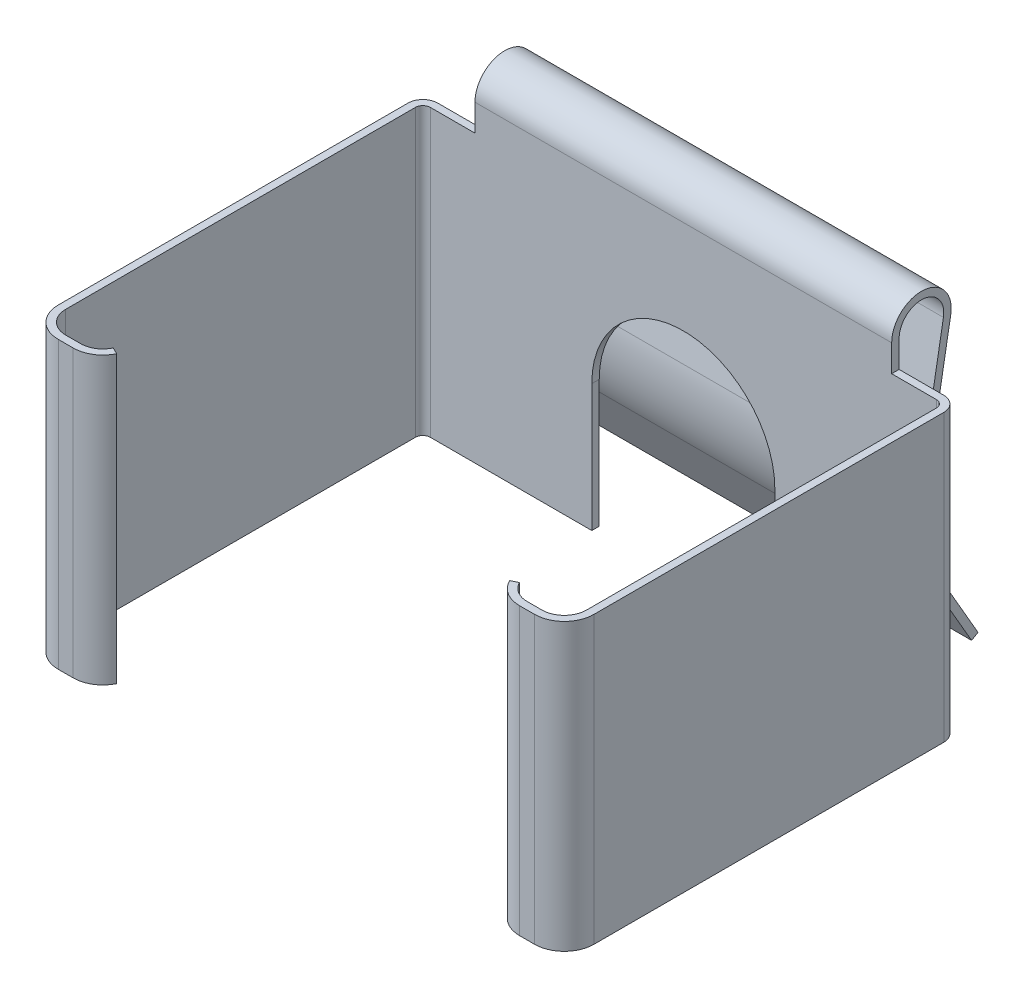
ISO-10303-21;
HEADER;
FILE_DESCRIPTION(('STEP AP214'),'2;1');
FILE_NAME('part.step','',(''),(''),'','','');
FILE_SCHEMA(('AUTOMOTIVE_DESIGN { 1 0 10303 214 1 1 1 1 }'));
ENDSEC;
DATA;
#1=APPLICATION_CONTEXT('core data for automotive mechanical design processes');
#2=APPLICATION_PROTOCOL_DEFINITION('international standard','automotive_design',2000,#1);
#3=PRODUCT_CONTEXT('',#1,'mechanical');
#4=PRODUCT('Part','Part','',(#3));
#5=PRODUCT_RELATED_PRODUCT_CATEGORY('part','',(#4));
#6=PRODUCT_DEFINITION_FORMATION('','',#4);
#7=PRODUCT_DEFINITION_CONTEXT('part definition',#1,'design');
#8=PRODUCT_DEFINITION('design','',#6,#7);
#9=PRODUCT_DEFINITION_SHAPE('','',#8);
#10=(LENGTH_UNIT() NAMED_UNIT(*) SI_UNIT(.MILLI.,.METRE.));
#11=(NAMED_UNIT(*) PLANE_ANGLE_UNIT() SI_UNIT($,.RADIAN.));
#12=(NAMED_UNIT(*) SI_UNIT($,.STERADIAN.) SOLID_ANGLE_UNIT());
#13=UNCERTAINTY_MEASURE_WITH_UNIT(LENGTH_MEASURE(1.E-05),#10,'distance_accuracy_value','');
#14=(GEOMETRIC_REPRESENTATION_CONTEXT(3) GLOBAL_UNCERTAINTY_ASSIGNED_CONTEXT((#13)) GLOBAL_UNIT_ASSIGNED_CONTEXT((#10,
#11,#12)) REPRESENTATION_CONTEXT('',''));
#15=CARTESIAN_POINT('',(0.,0.,0.));
#16=DIRECTION('',(0.,0.,1.));
#17=DIRECTION('',(1.,0.,0.));
#18=AXIS2_PLACEMENT_3D('',#15,#16,#17);
#19=CARTESIAN_POINT('',(-37.0000000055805,34.2,27.4999999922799));
#20=DIRECTION('',(0.,-1.,0.));
#21=DIRECTION('',(0.,0.,-1.));
#22=AXIS2_PLACEMENT_3D('',#19,#20,#21);
#23=CYLINDRICAL_SURFACE('',#22,1.50000000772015);
#24=DIRECTION('',(0.,1.,0.));
#25=VECTOR('',#24,1.);
#26=CARTESIAN_POINT('',(-37.,34.2,29.));
#27=LINE('',#26,#25);
#28=CARTESIAN_POINT('',(-37.0000000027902,34.2,29.));
#29=VERTEX_POINT('',#28);
#30=CARTESIAN_POINT('',(-37.0000000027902,15.,29.));
#31=VERTEX_POINT('',#30);
#32=EDGE_CURVE('E279',#29,#31,#27,.F.);
#33=ORIENTED_EDGE('',*,*,#32,.F.);
#34=CARTESIAN_POINT('',(-37.0000000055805,34.2,27.4999999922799));
#35=DIRECTION('',(0.,-1.,0.));
#36=DIRECTION('',(0.,0.,-1.));
#37=AXIS2_PLACEMENT_3D('',#34,#35,#36);
#38=CIRCLE('',#37,1.50000000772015);
#39=CARTESIAN_POINT('',(-35.65,34.2,28.15383484));
#40=VERTEX_POINT('',#39);
#41=EDGE_CURVE('E20',#40,#29,#38,.T.);
#42=ORIENTED_EDGE('',*,*,#41,.F.);
#43=DIRECTION('',(0.,1.,0.));
#44=VECTOR('',#43,1.);
#45=CARTESIAN_POINT('',(-35.65,34.2,28.15383484));
#46=LINE('',#45,#44);
#47=CARTESIAN_POINT('',(-35.65,15.,28.15383484));
#48=VERTEX_POINT('',#47);
#49=EDGE_CURVE('E276',#48,#40,#46,.T.);
#50=ORIENTED_EDGE('',*,*,#49,.F.);
#51=CARTESIAN_POINT('',(-37.0000000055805,15.,27.4999999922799));
#52=DIRECTION('',(0.,-1.,0.));
#53=DIRECTION('',(0.,0.,-1.));
#54=AXIS2_PLACEMENT_3D('',#51,#52,#53);
#55=CIRCLE('',#54,1.50000000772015);
#56=EDGE_CURVE('E282',#31,#48,#55,.F.);
#57=ORIENTED_EDGE('',*,*,#56,.F.);
#58=EDGE_LOOP('',(#33,#42,#50,#57));
#59=FACE_BOUND('',#58,.T.);
#60=ADVANCED_FACE('F17',(#59),#23,.F.);
#61=CARTESIAN_POINT('',(-6.99999999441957,34.2,27.4999999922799));
#62=DIRECTION('',(0.,-1.,0.));
#63=DIRECTION('',(0.,0.,-1.));
#64=AXIS2_PLACEMENT_3D('',#61,#62,#63);
#65=CYLINDRICAL_SURFACE('',#64,1.50000000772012);
#66=DIRECTION('',(0.,1.,0.));
#67=VECTOR('',#66,1.);
#68=CARTESIAN_POINT('',(-8.35,34.2,28.15383484));
#69=LINE('',#68,#67);
#70=CARTESIAN_POINT('',(-8.35,34.2,28.15383484));
#71=VERTEX_POINT('',#70);
#72=CARTESIAN_POINT('',(-8.35,15.,28.15383484));
#73=VERTEX_POINT('',#72);
#74=EDGE_CURVE('E300',#71,#73,#69,.F.);
#75=ORIENTED_EDGE('',*,*,#74,.F.);
#76=CARTESIAN_POINT('',(-6.99999999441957,34.2,27.4999999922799));
#77=DIRECTION('',(0.,-1.,0.));
#78=DIRECTION('',(0.,0.,-1.));
#79=AXIS2_PLACEMENT_3D('',#76,#77,#78);
#80=CIRCLE('',#79,1.50000000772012);
#81=CARTESIAN_POINT('',(-6.99999999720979,34.2,29.));
#82=VERTEX_POINT('',#81);
#83=EDGE_CURVE('E410',#82,#71,#80,.T.);
#84=ORIENTED_EDGE('',*,*,#83,.F.);
#85=DIRECTION('',(0.,1.,0.));
#86=VECTOR('',#85,1.);
#87=CARTESIAN_POINT('',(-7.,34.2,29.));
#88=LINE('',#87,#86);
#89=CARTESIAN_POINT('',(-6.99999999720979,15.,29.));
#90=VERTEX_POINT('',#89);
#91=EDGE_CURVE('E421',#90,#82,#88,.T.);
#92=ORIENTED_EDGE('',*,*,#91,.F.);
#93=CARTESIAN_POINT('',(-6.99999999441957,15.,27.4999999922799));
#94=DIRECTION('',(0.,-1.,0.));
#95=DIRECTION('',(0.,0.,-1.));
#96=AXIS2_PLACEMENT_3D('',#93,#94,#95);
#97=CIRCLE('',#96,1.50000000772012);
#98=EDGE_CURVE('E407',#73,#90,#97,.F.);
#99=ORIENTED_EDGE('',*,*,#98,.F.);
#100=EDGE_LOOP('',(#75,#84,#92,#99));
#101=FACE_BOUND('',#100,.T.);
#102=ADVANCED_FACE('F725',(#101),#65,.F.);
#103=CARTESIAN_POINT('',(-37.,34.2,29.));
#104=DIRECTION('',(0.,0.,-1.));
#105=DIRECTION('',(-1.,0.,0.));
#106=AXIS2_PLACEMENT_3D('',#103,#104,#105);
#107=PLANE('',#106);
#108=DIRECTION('',(-1.,0.,0.));
#109=VECTOR('',#108,1.);
#110=CARTESIAN_POINT('',(-37.,34.2,29.));
#111=LINE('',#110,#109);
#112=CARTESIAN_POINT('',(-37.9999999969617,34.2,29.));
#113=VERTEX_POINT('',#112);
#114=EDGE_CURVE('E303',#113,#29,#111,.F.);
#115=ORIENTED_EDGE('',*,*,#114,.T.);
#116=ORIENTED_EDGE('',*,*,#32,.T.);
#117=DIRECTION('',(-1.,0.,0.));
#118=VECTOR('',#117,1.);
#119=CARTESIAN_POINT('',(-37.,15.,29.));
#120=LINE('',#119,#118);
#121=CARTESIAN_POINT('',(-37.9999999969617,15.,29.));
#122=VERTEX_POINT('',#121);
#123=EDGE_CURVE('E409',#31,#122,#120,.T.);
#124=ORIENTED_EDGE('',*,*,#123,.T.);
#125=DIRECTION('',(0.,-1.,0.));
#126=VECTOR('',#125,1.);
#127=CARTESIAN_POINT('',(-38.,34.2,29.));
#128=LINE('',#127,#126);
#129=EDGE_CURVE('E417',#122,#113,#128,.F.);
#130=ORIENTED_EDGE('',*,*,#129,.T.);
#131=EDGE_LOOP('',(#115,#116,#124,#130));
#132=FACE_BOUND('',#131,.T.);
#133=ADVANCED_FACE('F414',(#132),#107,.T.);
#134=CARTESIAN_POINT('',(-35.2,34.2,28.37177979));
#135=DIRECTION('',(0.435889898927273,0.,-0.899999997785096));
#136=DIRECTION('',(-0.899999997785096,0.,-0.435889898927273));
#137=AXIS2_PLACEMENT_3D('',#134,#135,#136);
#138=PLANE('',#137);
#139=DIRECTION('',(-0.899999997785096,0.,-0.435889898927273));
#140=VECTOR('',#139,1.);
#141=CARTESIAN_POINT('',(-35.2,34.2,28.37177979));
#142=LINE('',#141,#140);
#143=CARTESIAN_POINT('',(-35.2,34.2,28.37177979));
#144=VERTEX_POINT('',#143);
#145=EDGE_CURVE('E284',#40,#144,#142,.F.);
#146=ORIENTED_EDGE('',*,*,#145,.T.);
#147=DIRECTION('',(0.,-1.,0.));
#148=VECTOR('',#147,1.);
#149=CARTESIAN_POINT('',(-35.2,34.2,28.37177979));
#150=LINE('',#149,#148);
#151=CARTESIAN_POINT('',(-35.2,15.,28.37177979));
#152=VERTEX_POINT('',#151);
#153=EDGE_CURVE('E570',#152,#144,#150,.F.);
#154=ORIENTED_EDGE('',*,*,#153,.F.);
#155=DIRECTION('',(-0.899999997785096,0.,-0.435889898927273));
#156=VECTOR('',#155,1.);
#157=CARTESIAN_POINT('',(-35.2,15.,28.37177979));
#158=LINE('',#157,#156);
#159=EDGE_CURVE('E295',#152,#48,#158,.T.);
#160=ORIENTED_EDGE('',*,*,#159,.T.);
#161=ORIENTED_EDGE('',*,*,#49,.T.);
#162=EDGE_LOOP('',(#146,#154,#160,#161));
#163=FACE_BOUND('',#162,.T.);
#164=ADVANCED_FACE('F294',(#163),#138,.T.);
#165=CARTESIAN_POINT('',(-38.,34.2,29.5));
#166=DIRECTION('',(0.,0.,1.));
#167=DIRECTION('',(1.,0.,0.));
#168=AXIS2_PLACEMENT_3D('',#165,#166,#167);
#169=PLANE('',#168);
#170=DIRECTION('',(1.,0.,0.));
#171=VECTOR('',#170,1.);
#172=CARTESIAN_POINT('',(-38.,34.2,29.5));
#173=LINE('',#172,#171);
#174=CARTESIAN_POINT('',(-37.0000000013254,34.2,29.5));
#175=VERTEX_POINT('',#174);
#176=CARTESIAN_POINT('',(-37.9999999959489,34.2,29.5));
#177=VERTEX_POINT('',#176);
#178=EDGE_CURVE('E445',#175,#177,#173,.F.);
#179=ORIENTED_EDGE('',*,*,#178,.T.);
#180=DIRECTION('',(0.,-1.,0.));
#181=VECTOR('',#180,1.);
#182=CARTESIAN_POINT('',(-38.,34.2,29.5));
#183=LINE('',#182,#181);
#184=CARTESIAN_POINT('',(-37.9999999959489,15.,29.5));
#185=VERTEX_POINT('',#184);
#186=EDGE_CURVE('E457',#185,#177,#183,.F.);
#187=ORIENTED_EDGE('',*,*,#186,.F.);
#188=DIRECTION('',(1.,0.,0.));
#189=VECTOR('',#188,1.);
#190=CARTESIAN_POINT('',(-38.,15.,29.5));
#191=LINE('',#190,#189);
#192=CARTESIAN_POINT('',(-37.0000000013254,15.,29.5));
#193=VERTEX_POINT('',#192);
#194=EDGE_CURVE('E292',#185,#193,#191,.T.);
#195=ORIENTED_EDGE('',*,*,#194,.T.);
#196=DIRECTION('',(0.,-1.,0.));
#197=VECTOR('',#196,1.);
#198=CARTESIAN_POINT('',(-37.,34.2,29.5));
#199=LINE('',#198,#197);
#200=EDGE_CURVE('E460',#175,#193,#199,.T.);
#201=ORIENTED_EDGE('',*,*,#200,.F.);
#202=EDGE_LOOP('',(#179,#187,#195,#201));
#203=FACE_BOUND('',#202,.T.);
#204=ADVANCED_FACE('F456',(#203),#169,.T.);
#205=CARTESIAN_POINT('',(-36.,16.24999999,-2.30000001));
#206=DIRECTION('',(0.,-0.866025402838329,-0.50000000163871));
#207=DIRECTION('',(0.,0.50000000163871,-0.866025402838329));
#208=AXIS2_PLACEMENT_3D('',#205,#206,#207);
#209=PLANE('',#208);
#210=DIRECTION('',(0.,0.50000000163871,-0.866025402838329));
#211=VECTOR('',#210,1.);
#212=CARTESIAN_POINT('',(-36.,16.24999999,-2.30000001));
#213=LINE('',#212,#211);
#214=CARTESIAN_POINT('',(-36.,15.99999999,-1.86698731));
#215=VERTEX_POINT('',#214);
#216=CARTESIAN_POINT('',(-36.,16.24999999,-2.30000001));
#217=VERTEX_POINT('',#216);
#218=EDGE_CURVE('E441',#215,#217,#213,.T.);
#219=ORIENTED_EDGE('',*,*,#218,.T.);
#220=DIRECTION('',(1.,0.,0.));
#221=VECTOR('',#220,1.);
#222=CARTESIAN_POINT('',(-36.,16.24999999,-2.30000001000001));
#223=LINE('',#222,#221);
#224=CARTESIAN_POINT('',(-7.99999999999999,16.24999999,-2.30000001));
#225=VERTEX_POINT('',#224);
#226=EDGE_CURVE('E548',#225,#217,#223,.F.);
#227=ORIENTED_EDGE('',*,*,#226,.F.);
#228=DIRECTION('',(0.,0.50000000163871,-0.866025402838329));
#229=VECTOR('',#228,1.);
#230=CARTESIAN_POINT('',(-7.99999999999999,16.24999999,-2.30000001));
#231=LINE('',#230,#229);
#232=CARTESIAN_POINT('',(-7.99999999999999,15.99999999,-1.86698731));
#233=VERTEX_POINT('',#232);
#234=EDGE_CURVE('E443',#225,#233,#231,.F.);
#235=ORIENTED_EDGE('',*,*,#234,.T.);
#236=DIRECTION('',(1.,0.,0.));
#237=VECTOR('',#236,1.);
#238=CARTESIAN_POINT('',(-36.,15.99999999,-1.86698731));
#239=LINE('',#238,#237);
#240=EDGE_CURVE('E551',#215,#233,#239,.T.);
#241=ORIENTED_EDGE('',*,*,#240,.F.);
#242=EDGE_LOOP('',(#219,#227,#235,#241));
#243=FACE_BOUND('',#242,.T.);
#244=ADVANCED_FACE('F1092',(#243),#209,.T.);
#245=CARTESIAN_POINT('',(-7.,34.2,29.5));
#246=DIRECTION('',(0.,0.,1.));
#247=DIRECTION('',(1.,0.,0.));
#248=AXIS2_PLACEMENT_3D('',#245,#246,#247);
#249=PLANE('',#248);
#250=DIRECTION('',(1.,0.,0.));
#251=VECTOR('',#250,1.);
#252=CARTESIAN_POINT('',(-7.,34.2,29.5));
#253=LINE('',#252,#251);
#254=CARTESIAN_POINT('',(-6.00000000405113,34.2,29.5));
#255=VERTEX_POINT('',#254);
#256=CARTESIAN_POINT('',(-6.99999999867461,34.2,29.5));
#257=VERTEX_POINT('',#256);
#258=EDGE_CURVE('E438',#255,#257,#253,.F.);
#259=ORIENTED_EDGE('',*,*,#258,.T.);
#260=DIRECTION('',(0.,-1.,0.));
#261=VECTOR('',#260,1.);
#262=CARTESIAN_POINT('',(-7.,34.2,29.5));
#263=LINE('',#262,#261);
#264=CARTESIAN_POINT('',(-6.99999999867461,15.,29.5));
#265=VERTEX_POINT('',#264);
#266=EDGE_CURVE('E530',#265,#257,#263,.F.);
#267=ORIENTED_EDGE('',*,*,#266,.F.);
#268=DIRECTION('',(1.,0.,0.));
#269=VECTOR('',#268,1.);
#270=CARTESIAN_POINT('',(-7.,15.,29.5));
#271=LINE('',#270,#269);
#272=CARTESIAN_POINT('',(-6.00000000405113,15.,29.5));
#273=VERTEX_POINT('',#272);
#274=EDGE_CURVE('E439',#265,#273,#271,.T.);
#275=ORIENTED_EDGE('',*,*,#274,.T.);
#276=DIRECTION('',(0.,-1.,0.));
#277=VECTOR('',#276,1.);
#278=CARTESIAN_POINT('',(-6.,34.2,29.5));
#279=LINE('',#278,#277);
#280=EDGE_CURVE('E533',#255,#273,#279,.T.);
#281=ORIENTED_EDGE('',*,*,#280,.F.);
#282=EDGE_LOOP('',(#259,#267,#275,#281));
#283=FACE_BOUND('',#282,.T.);
#284=ADVANCED_FACE('F713',(#283),#249,.T.);
#285=CARTESIAN_POINT('',(-8.35,34.2,28.15383484));
#286=DIRECTION('',(-0.435889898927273,0.,-0.899999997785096));
#287=DIRECTION('',(-0.899999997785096,0.,0.435889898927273));
#288=AXIS2_PLACEMENT_3D('',#285,#286,#287);
#289=PLANE('',#288);
#290=DIRECTION('',(-0.899999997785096,0.,0.435889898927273));
#291=VECTOR('',#290,1.);
#292=CARTESIAN_POINT('',(-8.35,34.2,28.15383484));
#293=LINE('',#292,#291);
#294=CARTESIAN_POINT('',(-8.8,34.2,28.37177979));
#295=VERTEX_POINT('',#294);
#296=EDGE_CURVE('E431',#295,#71,#293,.F.);
#297=ORIENTED_EDGE('',*,*,#296,.T.);
#298=ORIENTED_EDGE('',*,*,#74,.T.);
#299=DIRECTION('',(-0.899999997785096,0.,0.435889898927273));
#300=VECTOR('',#299,1.);
#301=CARTESIAN_POINT('',(-8.35,15.,28.15383484));
#302=LINE('',#301,#300);
#303=CARTESIAN_POINT('',(-8.8,15.,28.37177979));
#304=VERTEX_POINT('',#303);
#305=EDGE_CURVE('E436',#73,#304,#302,.T.);
#306=ORIENTED_EDGE('',*,*,#305,.T.);
#307=DIRECTION('',(0.,-1.,0.));
#308=VECTOR('',#307,1.);
#309=CARTESIAN_POINT('',(-8.8,34.2,28.37177979));
#310=LINE('',#309,#308);
#311=EDGE_CURVE('E527',#295,#304,#310,.T.);
#312=ORIENTED_EDGE('',*,*,#311,.F.);
#313=EDGE_LOOP('',(#297,#298,#306,#312));
#314=FACE_BOUND('',#313,.T.);
#315=ADVANCED_FACE('F722',(#314),#289,.T.);
#316=CARTESIAN_POINT('',(-6.,34.2,29.));
#317=DIRECTION('',(0.,0.,-1.));
#318=DIRECTION('',(-1.,0.,0.));
#319=AXIS2_PLACEMENT_3D('',#316,#317,#318);
#320=PLANE('',#319);
#321=DIRECTION('',(-1.,0.,0.));
#322=VECTOR('',#321,1.);
#323=CARTESIAN_POINT('',(-6.,34.2,29.));
#324=LINE('',#323,#322);
#325=CARTESIAN_POINT('',(-6.00000000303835,34.2,29.));
#326=VERTEX_POINT('',#325);
#327=EDGE_CURVE('E406',#82,#326,#324,.F.);
#328=ORIENTED_EDGE('',*,*,#327,.T.);
#329=DIRECTION('',(0.,-1.,0.));
#330=VECTOR('',#329,1.);
#331=CARTESIAN_POINT('',(-6.,34.2,29.));
#332=LINE('',#331,#330);
#333=CARTESIAN_POINT('',(-6.00000000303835,15.,29.));
#334=VERTEX_POINT('',#333);
#335=EDGE_CURVE('E523',#326,#334,#332,.T.);
#336=ORIENTED_EDGE('',*,*,#335,.T.);
#337=DIRECTION('',(-1.,0.,0.));
#338=VECTOR('',#337,1.);
#339=CARTESIAN_POINT('',(-6.,15.,29.));
#340=LINE('',#339,#338);
#341=EDGE_CURVE('E423',#334,#90,#340,.T.);
#342=ORIENTED_EDGE('',*,*,#341,.T.);
#343=ORIENTED_EDGE('',*,*,#91,.T.);
#344=EDGE_LOOP('',(#328,#336,#342,#343));
#345=FACE_BOUND('',#344,.T.);
#346=ADVANCED_FACE('F729',(#345),#320,.T.);
#347=CARTESIAN_POINT('',(-5.00000000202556,34.2,4.00000000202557));
#348=DIRECTION('',(0.,-1.,0.));
#349=DIRECTION('',(0.,0.,-1.));
#350=AXIS2_PLACEMENT_3D('',#347,#348,#349);
#351=CYLINDRICAL_SURFACE('',#350,0.500000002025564);
#352=DIRECTION('',(0.,1.,0.));
#353=VECTOR('',#352,1.);
#354=CARTESIAN_POINT('',(-4.5,34.2,4.));
#355=LINE('',#354,#353);
#356=CARTESIAN_POINT('',(-4.5,34.2,4.00000000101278));
#357=VERTEX_POINT('',#356);
#358=CARTESIAN_POINT('',(-4.5,15.,4.00000000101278));
#359=VERTEX_POINT('',#358);
#360=EDGE_CURVE('E519',#357,#359,#355,.F.);
#361=ORIENTED_EDGE('',*,*,#360,.F.);
#362=CARTESIAN_POINT('',(-5.00000000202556,34.2,4.00000000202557));
#363=DIRECTION('',(0.,-1.,0.));
#364=DIRECTION('',(0.,0.,-1.));
#365=AXIS2_PLACEMENT_3D('',#362,#363,#364);
#366=CIRCLE('',#365,0.500000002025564);
#367=CARTESIAN_POINT('',(-5.00000000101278,34.2,3.5));
#368=VERTEX_POINT('',#367);
#369=EDGE_CURVE('E404',#368,#357,#366,.T.);
#370=ORIENTED_EDGE('',*,*,#369,.F.);
#371=DIRECTION('',(0.,1.,0.));
#372=VECTOR('',#371,1.);
#373=CARTESIAN_POINT('',(-5.,34.2,3.5));
#374=LINE('',#373,#372);
#375=CARTESIAN_POINT('',(-5.00000000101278,15.,3.5));
#376=VERTEX_POINT('',#375);
#377=EDGE_CURVE('E515',#376,#368,#374,.T.);
#378=ORIENTED_EDGE('',*,*,#377,.F.);
#379=CARTESIAN_POINT('',(-5.00000000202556,15.,4.00000000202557));
#380=DIRECTION('',(0.,-1.,0.));
#381=DIRECTION('',(0.,0.,-1.));
#382=AXIS2_PLACEMENT_3D('',#379,#380,#381);
#383=CIRCLE('',#382,0.500000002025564);
#384=EDGE_CURVE('E402',#359,#376,#383,.F.);
#385=ORIENTED_EDGE('',*,*,#384,.F.);
#386=EDGE_LOOP('',(#361,#370,#378,#385));
#387=FACE_BOUND('',#386,.T.);
#388=ADVANCED_FACE('F741',(#387),#351,.F.);
#389=CARTESIAN_POINT('',(-38.9999999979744,34.2,4.00000000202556));
#390=DIRECTION('',(0.,-1.,0.));
#391=DIRECTION('',(0.,0.,-1.));
#392=AXIS2_PLACEMENT_3D('',#389,#390,#391);
#393=CYLINDRICAL_SURFACE('',#392,0.500000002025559);
#394=DIRECTION('',(0.,1.,0.));
#395=VECTOR('',#394,1.);
#396=CARTESIAN_POINT('',(-39.,34.2,3.5));
#397=LINE('',#396,#395);
#398=CARTESIAN_POINT('',(-38.9999999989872,34.2,3.5));
#399=VERTEX_POINT('',#398);
#400=CARTESIAN_POINT('',(-38.9999999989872,15.,3.5));
#401=VERTEX_POINT('',#400);
#402=EDGE_CURVE('E396',#399,#401,#397,.F.);
#403=ORIENTED_EDGE('',*,*,#402,.F.);
#404=CARTESIAN_POINT('',(-38.9999999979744,34.2,4.00000000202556));
#405=DIRECTION('',(0.,-1.,0.));
#406=DIRECTION('',(0.,0.,-1.));
#407=AXIS2_PLACEMENT_3D('',#404,#405,#406);
#408=CIRCLE('',#407,0.500000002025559);
#409=CARTESIAN_POINT('',(-39.5,34.2,4.00000000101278));
#410=VERTEX_POINT('',#409);
#411=EDGE_CURVE('E400',#410,#399,#408,.T.);
#412=ORIENTED_EDGE('',*,*,#411,.F.);
#413=DIRECTION('',(0.,1.,0.));
#414=VECTOR('',#413,1.);
#415=CARTESIAN_POINT('',(-39.5,34.2,4.));
#416=LINE('',#415,#414);
#417=CARTESIAN_POINT('',(-39.5,15.,4.00000000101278));
#418=VERTEX_POINT('',#417);
#419=EDGE_CURVE('E399',#418,#410,#416,.T.);
#420=ORIENTED_EDGE('',*,*,#419,.F.);
#421=CARTESIAN_POINT('',(-38.9999999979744,15.,4.00000000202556));
#422=DIRECTION('',(0.,-1.,0.));
#423=DIRECTION('',(0.,0.,-1.));
#424=AXIS2_PLACEMENT_3D('',#421,#422,#423);
#425=CIRCLE('',#424,0.500000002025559);
#426=EDGE_CURVE('E397',#401,#418,#425,.F.);
#427=ORIENTED_EDGE('',*,*,#426,.F.);
#428=EDGE_LOOP('',(#403,#412,#420,#427));
#429=FACE_BOUND('',#428,.T.);
#430=ADVANCED_FACE('F1049',(#429),#393,.F.);
#431=CARTESIAN_POINT('',(-39.5,34.2,27.5));
#432=DIRECTION('',(1.,0.,0.));
#433=DIRECTION('',(0.,0.,-1.));
#434=AXIS2_PLACEMENT_3D('',#431,#432,#433);
#435=PLANE('',#434);
#436=DIRECTION('',(0.,0.,-1.));
#437=VECTOR('',#436,1.);
#438=CARTESIAN_POINT('',(-39.5,34.2,12.6187808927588));
#439=LINE('',#438,#437);
#440=CARTESIAN_POINT('',(-39.5,34.2,27.4999999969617));
#441=VERTEX_POINT('',#440);
#442=EDGE_CURVE('E377',#410,#441,#439,.F.);
#443=ORIENTED_EDGE('',*,*,#442,.T.);
#444=DIRECTION('',(0.,-1.,0.));
#445=VECTOR('',#444,1.);
#446=CARTESIAN_POINT('',(-39.5,34.2,27.5));
#447=LINE('',#446,#445);
#448=CARTESIAN_POINT('',(-39.5,15.,27.4999999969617));
#449=VERTEX_POINT('',#448);
#450=EDGE_CURVE('E572',#441,#449,#447,.T.);
#451=ORIENTED_EDGE('',*,*,#450,.T.);
#452=DIRECTION('',(0.,0.,-1.));
#453=VECTOR('',#452,1.);
#454=CARTESIAN_POINT('',(-39.5,15.,12.6187808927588));
#455=LINE('',#454,#453);
#456=EDGE_CURVE('E392',#418,#449,#455,.F.);
#457=ORIENTED_EDGE('',*,*,#456,.F.);
#458=ORIENTED_EDGE('',*,*,#419,.T.);
#459=EDGE_LOOP('',(#443,#451,#457,#458));
#460=FACE_BOUND('',#459,.T.);
#461=ADVANCED_FACE('F1039',(#460),#435,.T.);
#462=CARTESIAN_POINT('',(-37.9999999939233,34.2,27.4999999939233));
#463=DIRECTION('',(0.,-1.,0.));
#464=DIRECTION('',(0.,0.,-1.));
#465=AXIS2_PLACEMENT_3D('',#462,#463,#464);
#466=CYLINDRICAL_SURFACE('',#465,1.5000000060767);
#467=ORIENTED_EDGE('',*,*,#450,.F.);
#468=CARTESIAN_POINT('',(-37.9999999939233,34.2,27.4999999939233));
#469=DIRECTION('',(0.,-1.,0.));
#470=DIRECTION('',(0.,0.,-1.));
#471=AXIS2_PLACEMENT_3D('',#468,#469,#470);
#472=CIRCLE('',#471,1.5000000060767);
#473=EDGE_CURVE('E374',#441,#113,#472,.F.);
#474=ORIENTED_EDGE('',*,*,#473,.T.);
#475=ORIENTED_EDGE('',*,*,#129,.F.);
#476=CARTESIAN_POINT('',(-37.9999999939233,15.,27.4999999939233));
#477=DIRECTION('',(0.,-1.,0.));
#478=DIRECTION('',(0.,0.,-1.));
#479=AXIS2_PLACEMENT_3D('',#476,#477,#478);
#480=CIRCLE('',#479,1.5000000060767);
#481=EDGE_CURVE('E389',#449,#122,#480,.F.);
#482=ORIENTED_EDGE('',*,*,#481,.F.);
#483=EDGE_LOOP('',(#467,#474,#475,#482));
#484=FACE_BOUND('',#483,.T.);
#485=ADVANCED_FACE('F1029',(#484),#466,.F.);
#486=CARTESIAN_POINT('',(-37.0000000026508,34.2,27.4999999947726));
#487=DIRECTION('',(0.,-1.,0.));
#488=DIRECTION('',(0.,0.,-1.));
#489=AXIS2_PLACEMENT_3D('',#486,#487,#488);
#490=CYLINDRICAL_SURFACE('',#489,2.00000000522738);
#491=CARTESIAN_POINT('',(-37.0000000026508,34.2,27.4999999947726));
#492=DIRECTION('',(0.,-1.,0.));
#493=DIRECTION('',(0.,0.,-1.));
#494=AXIS2_PLACEMENT_3D('',#491,#492,#493);
#495=CIRCLE('',#494,2.00000000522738);
#496=EDGE_CURVE('E288',#144,#175,#495,.T.);
#497=ORIENTED_EDGE('',*,*,#496,.T.);
#498=ORIENTED_EDGE('',*,*,#200,.T.);
#499=CARTESIAN_POINT('',(-37.0000000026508,15.,27.4999999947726));
#500=DIRECTION('',(0.,-1.,0.));
#501=DIRECTION('',(0.,0.,-1.));
#502=AXIS2_PLACEMENT_3D('',#499,#500,#501);
#503=CIRCLE('',#502,2.00000000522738);
#504=EDGE_CURVE('E386',#152,#193,#503,.T.);
#505=ORIENTED_EDGE('',*,*,#504,.F.);
#506=ORIENTED_EDGE('',*,*,#153,.T.);
#507=EDGE_LOOP('',(#497,#498,#505,#506));
#508=FACE_BOUND('',#507,.T.);
#509=ADVANCED_FACE('F1020',(#508),#490,.T.);
#510=CARTESIAN_POINT('',(-37.9999999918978,34.2,27.4999999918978));
#511=DIRECTION('',(0.,-1.,0.));
#512=DIRECTION('',(0.,0.,-1.));
#513=AXIS2_PLACEMENT_3D('',#510,#511,#512);
#514=CYLINDRICAL_SURFACE('',#513,2.00000000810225);
#515=CARTESIAN_POINT('',(-37.9999999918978,34.2,27.4999999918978));
#516=DIRECTION('',(0.,-1.,0.));
#517=DIRECTION('',(0.,0.,-1.));
#518=AXIS2_PLACEMENT_3D('',#515,#516,#517);
#519=CIRCLE('',#518,2.00000000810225);
#520=CARTESIAN_POINT('',(-40.,34.2,27.4999999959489));
#521=VERTEX_POINT('',#520);
#522=EDGE_CURVE('E371',#177,#521,#519,.T.);
#523=ORIENTED_EDGE('',*,*,#522,.T.);
#524=DIRECTION('',(0.,1.,0.));
#525=VECTOR('',#524,1.);
#526=CARTESIAN_POINT('',(-40.,34.2,27.5));
#527=LINE('',#526,#525);
#528=CARTESIAN_POINT('',(-40.,15.,27.4999999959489));
#529=VERTEX_POINT('',#528);
#530=EDGE_CURVE('E465',#529,#521,#527,.T.);
#531=ORIENTED_EDGE('',*,*,#530,.F.);
#532=CARTESIAN_POINT('',(-37.9999999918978,15.,27.4999999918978));
#533=DIRECTION('',(0.,-1.,0.));
#534=DIRECTION('',(0.,0.,-1.));
#535=AXIS2_PLACEMENT_3D('',#532,#533,#534);
#536=CIRCLE('',#535,2.00000000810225);
#537=EDGE_CURVE('E383',#185,#529,#536,.T.);
#538=ORIENTED_EDGE('',*,*,#537,.F.);
#539=ORIENTED_EDGE('',*,*,#186,.T.);
#540=EDGE_LOOP('',(#523,#531,#538,#539));
#541=FACE_BOUND('',#540,.T.);
#542=ADVANCED_FACE('F463',(#541),#514,.T.);
#543=CARTESIAN_POINT('',(-40.,34.2,4.));
#544=DIRECTION('',(-1.,0.,0.));
#545=DIRECTION('',(0.,0.,1.));
#546=AXIS2_PLACEMENT_3D('',#543,#544,#545);
#547=PLANE('',#546);
#548=DIRECTION('',(0.,0.,-1.));
#549=VECTOR('',#548,1.);
#550=CARTESIAN_POINT('',(-40.,34.2,12.6187808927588));
#551=LINE('',#550,#549);
#552=CARTESIAN_POINT('',(-40.,34.2,4.00000000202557));
#553=VERTEX_POINT('',#552);
#554=EDGE_CURVE('E370',#521,#553,#551,.T.);
#555=ORIENTED_EDGE('',*,*,#554,.T.);
#556=DIRECTION('',(0.,-1.,0.));
#557=VECTOR('',#556,1.);
#558=CARTESIAN_POINT('',(-40.,34.2,4.));
#559=LINE('',#558,#557);
#560=CARTESIAN_POINT('',(-40.,15.,4.00000000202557));
#561=VERTEX_POINT('',#560);
#562=EDGE_CURVE('E381',#561,#553,#559,.F.);
#563=ORIENTED_EDGE('',*,*,#562,.F.);
#564=DIRECTION('',(0.,0.,-1.));
#565=VECTOR('',#564,1.);
#566=CARTESIAN_POINT('',(-40.,15.,12.6187808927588));
#567=LINE('',#566,#565);
#568=EDGE_CURVE('E382',#529,#561,#567,.T.);
#569=ORIENTED_EDGE('',*,*,#568,.F.);
#570=ORIENTED_EDGE('',*,*,#530,.T.);
#571=EDGE_LOOP('',(#555,#563,#569,#570));
#572=FACE_BOUND('',#571,.T.);
#573=ADVANCED_FACE('F1002',(#572),#547,.T.);
#574=CARTESIAN_POINT('',(-36.,25.99310494,1.74134566));
#575=DIRECTION('',(0.,0.173648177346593,0.984807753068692));
#576=DIRECTION('',(0.,-0.984807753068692,0.173648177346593));
#577=AXIS2_PLACEMENT_3D('',#574,#575,#576);
#578=PLANE('',#577);
#579=DIRECTION('',(0.,-0.984807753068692,0.173648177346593));
#580=VECTOR('',#579,1.);
#581=CARTESIAN_POINT('',(-36.,35.73952773,0.02278836));
#582=LINE('',#581,#580);
#583=CARTESIAN_POINT('',(-36.,35.7395277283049,0.0227883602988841));
#584=VERTEX_POINT('',#583);
#585=CARTESIAN_POINT('',(-36.,25.9931049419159,1.74134565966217));
#586=VERTEX_POINT('',#585);
#587=EDGE_CURVE('E367',#584,#586,#582,.T.);
#588=ORIENTED_EDGE('',*,*,#587,.T.);
#589=DIRECTION('',(1.,0.,0.));
#590=VECTOR('',#589,1.);
#591=CARTESIAN_POINT('',(-36.,25.99310494,1.74134566));
#592=LINE('',#591,#590);
#593=CARTESIAN_POINT('',(-8.,25.9931049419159,1.74134565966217));
#594=VERTEX_POINT('',#593);
#595=EDGE_CURVE('E557',#594,#586,#592,.F.);
#596=ORIENTED_EDGE('',*,*,#595,.F.);
#597=DIRECTION('',(0.,-0.984807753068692,0.173648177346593));
#598=VECTOR('',#597,1.);
#599=CARTESIAN_POINT('',(-8.,35.73952773,0.02278836));
#600=LINE('',#599,#598);
#601=CARTESIAN_POINT('',(-8.,35.7395277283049,0.0227883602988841));
#602=VERTEX_POINT('',#601);
#603=EDGE_CURVE('E349',#602,#594,#600,.T.);
#604=ORIENTED_EDGE('',*,*,#603,.F.);
#605=DIRECTION('',(1.,0.,0.));
#606=VECTOR('',#605,1.);
#607=CARTESIAN_POINT('',(-36.,35.73952773,0.0227883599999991));
#608=LINE('',#607,#606);
#609=EDGE_CURVE('E356',#602,#584,#608,.F.);
#610=ORIENTED_EDGE('',*,*,#609,.T.);
#611=EDGE_LOOP('',(#588,#596,#604,#610));
#612=FACE_BOUND('',#611,.T.);
#613=ADVANCED_FACE('F992',(#612),#578,.T.);
#614=CARTESIAN_POINT('',(-36.,24.60391952,-6.13711639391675));
#615=DIRECTION('',(1.,0.,0.));
#616=DIRECTION('',(0.,0.,-1.));
#617=AXIS2_PLACEMENT_3D('',#614,#615,#616);
#618=CYLINDRICAL_SURFACE('',#617,8.00000002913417);
#619=CARTESIAN_POINT('',(-36.,24.60391952,-6.13711639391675));
#620=DIRECTION('',(1.,0.,0.));
#621=DIRECTION('',(0.,0.,-1.));
#622=AXIS2_PLACEMENT_3D('',#619,#620,#621);
#623=CIRCLE('',#622,8.00000002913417);
#624=CARTESIAN_POINT('',(-36.,20.6039195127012,0.791086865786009));
#625=VERTEX_POINT('',#624);
#626=EDGE_CURVE('E364',#586,#625,#623,.T.);
#627=ORIENTED_EDGE('',*,*,#626,.T.);
#628=DIRECTION('',(1.,0.,0.));
#629=VECTOR('',#628,1.);
#630=CARTESIAN_POINT('',(-36.,20.60391952,0.791086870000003));
#631=LINE('',#630,#629);
#632=CARTESIAN_POINT('',(-8.,20.6039195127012,0.791086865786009));
#633=VERTEX_POINT('',#632);
#634=EDGE_CURVE('E554',#633,#625,#631,.F.);
#635=ORIENTED_EDGE('',*,*,#634,.F.);
#636=CARTESIAN_POINT('',(-8.,24.60391952,-6.13711639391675));
#637=DIRECTION('',(1.,0.,0.));
#638=DIRECTION('',(0.,0.,-1.));
#639=AXIS2_PLACEMENT_3D('',#636,#637,#638);
#640=CIRCLE('',#639,8.00000002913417);
#641=EDGE_CURVE('E345',#594,#633,#640,.T.);
#642=ORIENTED_EDGE('',*,*,#641,.F.);
#643=ORIENTED_EDGE('',*,*,#595,.T.);
#644=EDGE_LOOP('',(#627,#635,#642,#643));
#645=FACE_BOUND('',#644,.T.);
#646=ADVANCED_FACE('F982',(#645),#618,.T.);
#647=CARTESIAN_POINT('',(-36.,15.99999999,-1.86698731));
#648=DIRECTION('',(0.,-0.500000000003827,0.866025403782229));
#649=DIRECTION('',(0.,-0.866025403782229,-0.500000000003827));
#650=AXIS2_PLACEMENT_3D('',#647,#648,#649);
#651=PLANE('',#650);
#652=DIRECTION('',(0.,-0.866025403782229,-0.500000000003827));
#653=VECTOR('',#652,1.);
#654=CARTESIAN_POINT('',(-36.,20.60391952,0.79108687));
#655=LINE('',#654,#653);
#656=EDGE_CURVE('E366',#625,#215,#655,.T.);
#657=ORIENTED_EDGE('',*,*,#656,.T.);
#658=ORIENTED_EDGE('',*,*,#240,.T.);
#659=DIRECTION('',(0.,-0.866025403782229,-0.500000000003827));
#660=VECTOR('',#659,1.);
#661=CARTESIAN_POINT('',(-8.,20.60391952,0.79108687));
#662=LINE('',#661,#660);
#663=EDGE_CURVE('E348',#633,#233,#662,.T.);
#664=ORIENTED_EDGE('',*,*,#663,.F.);
#665=ORIENTED_EDGE('',*,*,#634,.T.);
#666=EDGE_LOOP('',(#657,#658,#664,#665));
#667=FACE_BOUND('',#666,.T.);
#668=ADVANCED_FACE('F972',(#667),#651,.T.);
#669=CARTESIAN_POINT('',(-36.,20.85391952,0.358074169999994));
#670=DIRECTION('',(0.,0.500000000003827,-0.866025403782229));
#671=DIRECTION('',(0.,0.866025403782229,0.500000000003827));
#672=AXIS2_PLACEMENT_3D('',#669,#670,#671);
#673=PLANE('',#672);
#674=DIRECTION('',(0.,0.86602540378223,0.500000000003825));
#675=VECTOR('',#674,1.);
#676=CARTESIAN_POINT('',(-36.,16.24999999,-2.30000001));
#677=LINE('',#676,#675);
#678=CARTESIAN_POINT('',(-36.,20.8539195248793,0.358074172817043));
#679=VERTEX_POINT('',#678);
#680=EDGE_CURVE('E363',#217,#679,#677,.T.);
#681=ORIENTED_EDGE('',*,*,#680,.T.);
#682=DIRECTION('',(1.,0.,0.));
#683=VECTOR('',#682,1.);
#684=CARTESIAN_POINT('',(-36.,20.85391952,0.358074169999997));
#685=LINE('',#684,#683);
#686=CARTESIAN_POINT('',(-8.,20.8539195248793,0.358074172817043));
#687=VERTEX_POINT('',#686);
#688=EDGE_CURVE('E546',#679,#687,#685,.T.);
#689=ORIENTED_EDGE('',*,*,#688,.T.);
#690=DIRECTION('',(0.,0.86602540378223,0.500000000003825));
#691=VECTOR('',#690,1.);
#692=CARTESIAN_POINT('',(-8.,16.24999999,-2.30000001));
#693=LINE('',#692,#691);
#694=EDGE_CURVE('E344',#225,#687,#693,.T.);
#695=ORIENTED_EDGE('',*,*,#694,.F.);
#696=ORIENTED_EDGE('',*,*,#226,.T.);
#697=EDGE_LOOP('',(#681,#689,#695,#696));
#698=FACE_BOUND('',#697,.T.);
#699=ADVANCED_FACE('F962',(#698),#673,.T.);
#700=CARTESIAN_POINT('',(-36.,24.603919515,-6.13711632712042));
#701=DIRECTION('',(1.,0.,0.));
#702=DIRECTION('',(0.,0.,-1.));
#703=AXIS2_PLACEMENT_3D('',#700,#701,#702);
#704=CYLINDRICAL_SURFACE('',#703,7.49999997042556);
#705=ORIENTED_EDGE('',*,*,#688,.F.);
#706=CARTESIAN_POINT('',(-36.,24.603919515,-6.13711632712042));
#707=DIRECTION('',(1.,0.,0.));
#708=DIRECTION('',(0.,0.,-1.));
#709=AXIS2_PLACEMENT_3D('',#706,#707,#708);
#710=CIRCLE('',#709,7.49999997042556);
#711=CARTESIAN_POINT('',(-36.,25.906280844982,1.24894179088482));
#712=VERTEX_POINT('',#711);
#713=EDGE_CURVE('E361',#679,#712,#710,.F.);
#714=ORIENTED_EDGE('',*,*,#713,.T.);
#715=DIRECTION('',(1.,0.,0.));
#716=VECTOR('',#715,1.);
#717=CARTESIAN_POINT('',(-36.,25.90628085,1.24894179));
#718=LINE('',#717,#716);
#719=CARTESIAN_POINT('',(-8.,25.906280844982,1.24894179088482));
#720=VERTEX_POINT('',#719);
#721=EDGE_CURVE('E543',#720,#712,#718,.F.);
#722=ORIENTED_EDGE('',*,*,#721,.F.);
#723=CARTESIAN_POINT('',(-8.,24.603919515,-6.13711632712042));
#724=DIRECTION('',(1.,0.,0.));
#725=DIRECTION('',(0.,0.,-1.));
#726=AXIS2_PLACEMENT_3D('',#723,#724,#725);
#727=CIRCLE('',#726,7.49999997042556);
#728=EDGE_CURVE('E341',#687,#720,#727,.F.);
#729=ORIENTED_EDGE('',*,*,#728,.F.);
#730=EDGE_LOOP('',(#705,#714,#722,#729));
#731=FACE_BOUND('',#730,.T.);
#732=ADVANCED_FACE('F952',(#731),#704,.F.);
#733=CARTESIAN_POINT('',(-36.,35.65270364,-0.46961551));
#734=DIRECTION('',(0.,-0.173648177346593,-0.984807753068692));
#735=DIRECTION('',(0.,0.984807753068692,-0.173648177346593));
#736=AXIS2_PLACEMENT_3D('',#733,#734,#735);
#737=PLANE('',#736);
#738=DIRECTION('',(0.,0.984807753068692,-0.173648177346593));
#739=VECTOR('',#738,1.);
#740=CARTESIAN_POINT('',(-36.,25.90628085,1.24894179));
#741=LINE('',#740,#739);
#742=CARTESIAN_POINT('',(-36.,35.6527036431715,-0.469615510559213));
#743=VERTEX_POINT('',#742);
#744=EDGE_CURVE('E360',#712,#743,#741,.T.);
#745=ORIENTED_EDGE('',*,*,#744,.T.);
#746=DIRECTION('',(1.,0.,0.));
#747=VECTOR('',#746,1.);
#748=CARTESIAN_POINT('',(-36.,35.65270364,-0.46961551));
#749=LINE('',#748,#747);
#750=CARTESIAN_POINT('',(-8.,35.6527036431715,-0.469615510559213));
#751=VERTEX_POINT('',#750);
#752=EDGE_CURVE('E539',#751,#743,#749,.F.);
#753=ORIENTED_EDGE('',*,*,#752,.F.);
#754=DIRECTION('',(0.,0.984807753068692,-0.173648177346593));
#755=VECTOR('',#754,1.);
#756=CARTESIAN_POINT('',(-8.,25.90628085,1.24894179));
#757=LINE('',#756,#755);
#758=EDGE_CURVE('E340',#720,#751,#757,.T.);
#759=ORIENTED_EDGE('',*,*,#758,.F.);
#760=ORIENTED_EDGE('',*,*,#721,.T.);
#761=EDGE_LOOP('',(#745,#753,#759,#760));
#762=FACE_BOUND('',#761,.T.);
#763=ADVANCED_FACE('F942',(#762),#737,.T.);
#764=CARTESIAN_POINT('',(-36.,36.0000000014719,1.49999999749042));
#765=DIRECTION('',(1.,0.,0.));
#766=DIRECTION('',(0.,0.,-1.));
#767=AXIS2_PLACEMENT_3D('',#764,#765,#766);
#768=CYLINDRICAL_SURFACE('',#767,2.00000000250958);
#769=CARTESIAN_POINT('',(-36.,36.0000000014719,1.49999999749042));
#770=DIRECTION('',(1.,0.,0.));
#771=DIRECTION('',(0.,0.,-1.));
#772=AXIS2_PLACEMENT_3D('',#769,#770,#771);
#773=CIRCLE('',#772,2.00000000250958);
#774=CARTESIAN_POINT('',(-36.,36.000000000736,3.5));
#775=VERTEX_POINT('',#774);
#776=EDGE_CURVE('E357',#743,#775,#773,.T.);
#777=ORIENTED_EDGE('',*,*,#776,.T.);
#778=DIRECTION('',(1.,0.,0.));
#779=VECTOR('',#778,1.);
#780=CARTESIAN_POINT('',(-39.,36.,3.5));
#781=LINE('',#780,#779);
#782=CARTESIAN_POINT('',(-8.,36.000000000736,3.5));
#783=VERTEX_POINT('',#782);
#784=EDGE_CURVE('E518',#783,#775,#781,.F.);
#785=ORIENTED_EDGE('',*,*,#784,.F.);
#786=CARTESIAN_POINT('',(-8.,36.0000000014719,1.49999999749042));
#787=DIRECTION('',(1.,0.,0.));
#788=DIRECTION('',(0.,0.,-1.));
#789=AXIS2_PLACEMENT_3D('',#786,#787,#788);
#790=CIRCLE('',#789,2.00000000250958);
#791=EDGE_CURVE('E337',#751,#783,#790,.T.);
#792=ORIENTED_EDGE('',*,*,#791,.F.);
#793=ORIENTED_EDGE('',*,*,#752,.T.);
#794=EDGE_LOOP('',(#777,#785,#792,#793));
#795=FACE_BOUND('',#794,.T.);
#796=ADVANCED_FACE('F933',(#795),#768,.T.);
#797=CARTESIAN_POINT('',(-4.,34.2,27.5));
#798=DIRECTION('',(1.,0.,0.));
#799=DIRECTION('',(0.,0.,-1.));
#800=AXIS2_PLACEMENT_3D('',#797,#798,#799);
#801=PLANE('',#800);
#802=DIRECTION('',(0.,0.,-1.));
#803=VECTOR('',#802,1.);
#804=CARTESIAN_POINT('',(-4.,34.2,12.6187808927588));
#805=LINE('',#804,#803);
#806=CARTESIAN_POINT('',(-4.,34.2,4.00000000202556));
#807=VERTEX_POINT('',#806);
#808=CARTESIAN_POINT('',(-4.,34.2,27.4999999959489));
#809=VERTEX_POINT('',#808);
#810=EDGE_CURVE('E336',#807,#809,#805,.F.);
#811=ORIENTED_EDGE('',*,*,#810,.T.);
#812=DIRECTION('',(0.,-1.,0.));
#813=VECTOR('',#812,1.);
#814=CARTESIAN_POINT('',(-4.,34.2,27.5));
#815=LINE('',#814,#813);
#816=CARTESIAN_POINT('',(-4.,15.,27.4999999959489));
#817=VERTEX_POINT('',#816);
#818=EDGE_CURVE('E536',#817,#809,#815,.F.);
#819=ORIENTED_EDGE('',*,*,#818,.F.);
#820=DIRECTION('',(0.,0.,-1.));
#821=VECTOR('',#820,1.);
#822=CARTESIAN_POINT('',(-4.,15.,12.6187808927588));
#823=LINE('',#822,#821);
#824=CARTESIAN_POINT('',(-4.,15.,4.00000000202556));
#825=VERTEX_POINT('',#824);
#826=EDGE_CURVE('E318',#825,#817,#823,.F.);
#827=ORIENTED_EDGE('',*,*,#826,.F.);
#828=DIRECTION('',(0.,-1.,0.));
#829=VECTOR('',#828,1.);
#830=CARTESIAN_POINT('',(-4.,34.2,4.));
#831=LINE('',#830,#829);
#832=EDGE_CURVE('E322',#807,#825,#831,.T.);
#833=ORIENTED_EDGE('',*,*,#832,.F.);
#834=EDGE_LOOP('',(#811,#819,#827,#833));
#835=FACE_BOUND('',#834,.T.);
#836=ADVANCED_FACE('F708',(#835),#801,.T.);
#837=CARTESIAN_POINT('',(-6.00000000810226,34.2,27.4999999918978));
#838=DIRECTION('',(0.,-1.,0.));
#839=DIRECTION('',(0.,0.,-1.));
#840=AXIS2_PLACEMENT_3D('',#837,#838,#839);
#841=CYLINDRICAL_SURFACE('',#840,2.00000000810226);
#842=CARTESIAN_POINT('',(-6.00000000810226,34.2,27.4999999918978));
#843=DIRECTION('',(0.,-1.,0.));
#844=DIRECTION('',(0.,0.,-1.));
#845=AXIS2_PLACEMENT_3D('',#842,#843,#844);
#846=CIRCLE('',#845,2.00000000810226);
#847=EDGE_CURVE('E333',#809,#255,#846,.T.);
#848=ORIENTED_EDGE('',*,*,#847,.T.);
#849=ORIENTED_EDGE('',*,*,#280,.T.);
#850=CARTESIAN_POINT('',(-6.00000000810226,15.,27.4999999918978));
#851=DIRECTION('',(0.,-1.,0.));
#852=DIRECTION('',(0.,0.,-1.));
#853=AXIS2_PLACEMENT_3D('',#850,#851,#852);
#854=CIRCLE('',#853,2.00000000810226);
#855=EDGE_CURVE('E315',#817,#273,#854,.T.);
#856=ORIENTED_EDGE('',*,*,#855,.F.);
#857=ORIENTED_EDGE('',*,*,#818,.T.);
#858=EDGE_LOOP('',(#848,#849,#856,#857));
#859=FACE_BOUND('',#858,.T.);
#860=ADVANCED_FACE('F710',(#859),#841,.T.);
#861=CARTESIAN_POINT('',(-6.99999999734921,34.2,27.4999999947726));
#862=DIRECTION('',(0.,-1.,0.));
#863=DIRECTION('',(0.,0.,-1.));
#864=AXIS2_PLACEMENT_3D('',#861,#862,#863);
#865=CYLINDRICAL_SURFACE('',#864,2.00000000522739);
#866=CARTESIAN_POINT('',(-6.99999999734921,34.2,27.4999999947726));
#867=DIRECTION('',(0.,-1.,0.));
#868=DIRECTION('',(0.,0.,-1.));
#869=AXIS2_PLACEMENT_3D('',#866,#867,#868);
#870=CIRCLE('',#869,2.00000000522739);
#871=EDGE_CURVE('E330',#257,#295,#870,.T.);
#872=ORIENTED_EDGE('',*,*,#871,.T.);
#873=ORIENTED_EDGE('',*,*,#311,.T.);
#874=CARTESIAN_POINT('',(-6.99999999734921,15.,27.4999999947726));
#875=DIRECTION('',(0.,-1.,0.));
#876=DIRECTION('',(0.,0.,-1.));
#877=AXIS2_PLACEMENT_3D('',#874,#875,#876);
#878=CIRCLE('',#877,2.00000000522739);
#879=EDGE_CURVE('E312',#265,#304,#878,.T.);
#880=ORIENTED_EDGE('',*,*,#879,.F.);
#881=ORIENTED_EDGE('',*,*,#266,.T.);
#882=EDGE_LOOP('',(#872,#873,#880,#881));
#883=FACE_BOUND('',#882,.T.);
#884=ADVANCED_FACE('F718',(#883),#865,.T.);
#885=CARTESIAN_POINT('',(-6.0000000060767,34.2,27.4999999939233));
#886=DIRECTION('',(0.,-1.,0.));
#887=DIRECTION('',(0.,0.,-1.));
#888=AXIS2_PLACEMENT_3D('',#885,#886,#887);
#889=CYLINDRICAL_SURFACE('',#888,1.5000000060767);
#890=ORIENTED_EDGE('',*,*,#335,.F.);
#891=CARTESIAN_POINT('',(-6.0000000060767,34.2,27.4999999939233));
#892=DIRECTION('',(0.,-1.,0.));
#893=DIRECTION('',(0.,0.,-1.));
#894=AXIS2_PLACEMENT_3D('',#891,#892,#893);
#895=CIRCLE('',#894,1.5000000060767);
#896=CARTESIAN_POINT('',(-4.5,34.2,27.4999999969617));
#897=VERTEX_POINT('',#896);
#898=EDGE_CURVE('E327',#326,#897,#895,.F.);
#899=ORIENTED_EDGE('',*,*,#898,.T.);
#900=DIRECTION('',(0.,1.,0.));
#901=VECTOR('',#900,1.);
#902=CARTESIAN_POINT('',(-4.5,34.2,27.5));
#903=LINE('',#902,#901);
#904=CARTESIAN_POINT('',(-4.5,15.,27.4999999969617));
#905=VERTEX_POINT('',#904);
#906=EDGE_CURVE('E520',#905,#897,#903,.T.);
#907=ORIENTED_EDGE('',*,*,#906,.F.);
#908=CARTESIAN_POINT('',(-6.0000000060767,15.,27.4999999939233));
#909=DIRECTION('',(0.,-1.,0.));
#910=DIRECTION('',(0.,0.,-1.));
#911=AXIS2_PLACEMENT_3D('',#908,#909,#910);
#912=CIRCLE('',#911,1.5000000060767);
#913=EDGE_CURVE('E308',#334,#905,#912,.F.);
#914=ORIENTED_EDGE('',*,*,#913,.F.);
#915=EDGE_LOOP('',(#890,#899,#907,#914));
#916=FACE_BOUND('',#915,.T.);
#917=ADVANCED_FACE('F732',(#916),#889,.F.);
#918=CARTESIAN_POINT('',(-4.5,34.2,4.));
#919=DIRECTION('',(-1.,0.,0.));
#920=DIRECTION('',(0.,0.,1.));
#921=AXIS2_PLACEMENT_3D('',#918,#919,#920);
#922=PLANE('',#921);
#923=DIRECTION('',(0.,0.,-1.));
#924=VECTOR('',#923,1.);
#925=CARTESIAN_POINT('',(-4.5,34.2,12.6187808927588));
#926=LINE('',#925,#924);
#927=EDGE_CURVE('E329',#897,#357,#926,.T.);
#928=ORIENTED_EDGE('',*,*,#927,.T.);
#929=ORIENTED_EDGE('',*,*,#360,.T.);
#930=DIRECTION('',(0.,0.,-1.));
#931=VECTOR('',#930,1.);
#932=CARTESIAN_POINT('',(-4.5,15.,12.6187808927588));
#933=LINE('',#932,#931);
#934=EDGE_CURVE('E311',#905,#359,#933,.T.);
#935=ORIENTED_EDGE('',*,*,#934,.F.);
#936=ORIENTED_EDGE('',*,*,#906,.T.);
#937=EDGE_LOOP('',(#928,#929,#935,#936));
#938=FACE_BOUND('',#937,.T.);
#939=ADVANCED_FACE('F736',(#938),#922,.T.);
#940=CARTESIAN_POINT('',(-39.,34.2,3.5));
#941=DIRECTION('',(0.,0.,1.));
#942=DIRECTION('',(1.,0.,0.));
#943=AXIS2_PLACEMENT_3D('',#940,#941,#942);
#944=PLANE('',#943);
#945=DIRECTION('',(1.,0.,0.));
#946=VECTOR('',#945,1.);
#947=CARTESIAN_POINT('',(-22.,15.,3.5));
#948=LINE('',#947,#946);
#949=CARTESIAN_POINT('',(-28.15,15.,3.5));
#950=VERTEX_POINT('',#949);
#951=EDGE_CURVE('E495',#950,#401,#948,.F.);
#952=ORIENTED_EDGE('',*,*,#951,.F.);
#953=DIRECTION('',(0.,1.,0.));
#954=VECTOR('',#953,1.);
#955=CARTESIAN_POINT('',(-28.15,19.275,3.5));
#956=LINE('',#955,#954);
#957=CARTESIAN_POINT('',(-28.15,23.55,3.5));
#958=VERTEX_POINT('',#957);
#959=EDGE_CURVE('E395',#958,#950,#956,.F.);
#960=ORIENTED_EDGE('',*,*,#959,.F.);
#961=CARTESIAN_POINT('',(-22.,23.55,3.5));
#962=DIRECTION('',(0.,0.,1.));
#963=DIRECTION('',(1.,0.,0.));
#964=AXIS2_PLACEMENT_3D('',#961,#962,#963);
#965=CIRCLE('',#964,6.15);
#966=CARTESIAN_POINT('',(-15.85,23.55,3.5));
#967=VERTEX_POINT('',#966);
#968=EDGE_CURVE('E393',#958,#967,#965,.F.);
#969=ORIENTED_EDGE('',*,*,#968,.T.);
#970=DIRECTION('',(0.,1.,0.));
#971=VECTOR('',#970,1.);
#972=CARTESIAN_POINT('',(-15.85,19.275,3.5));
#973=LINE('',#972,#971);
#974=CARTESIAN_POINT('',(-15.85,15.,3.5));
#975=VERTEX_POINT('',#974);
#976=EDGE_CURVE('E508',#975,#967,#973,.T.);
#977=ORIENTED_EDGE('',*,*,#976,.F.);
#978=DIRECTION('',(1.,0.,0.));
#979=VECTOR('',#978,1.);
#980=CARTESIAN_POINT('',(-22.,15.,3.5));
#981=LINE('',#980,#979);
#982=EDGE_CURVE('E512',#376,#975,#981,.F.);
#983=ORIENTED_EDGE('',*,*,#982,.F.);
#984=ORIENTED_EDGE('',*,*,#377,.T.);
#985=DIRECTION('',(1.,0.,0.));
#986=VECTOR('',#985,1.);
#987=CARTESIAN_POINT('',(-22.,34.2,3.5));
#988=LINE('',#987,#986);
#989=CARTESIAN_POINT('',(-8.,34.2,3.5));
#990=VERTEX_POINT('',#989);
#991=EDGE_CURVE('E625',#368,#990,#988,.F.);
#992=ORIENTED_EDGE('',*,*,#991,.T.);
#993=DIRECTION('',(0.,1.,0.));
#994=VECTOR('',#993,1.);
#995=CARTESIAN_POINT('',(-8.,28.5169735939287,3.5));
#996=LINE('',#995,#994);
#997=EDGE_CURVE('E353',#783,#990,#996,.F.);
#998=ORIENTED_EDGE('',*,*,#997,.F.);
#999=ORIENTED_EDGE('',*,*,#784,.T.);
#1000=DIRECTION('',(0.,1.,0.));
#1001=VECTOR('',#1000,1.);
#1002=CARTESIAN_POINT('',(-36.,28.5169735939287,3.5));
#1003=LINE('',#1002,#1001);
#1004=CARTESIAN_POINT('',(-36.,34.2,3.5));
#1005=VERTEX_POINT('',#1004);
#1006=EDGE_CURVE('E359',#775,#1005,#1003,.F.);
#1007=ORIENTED_EDGE('',*,*,#1006,.T.);
#1008=DIRECTION('',(1.,0.,0.));
#1009=VECTOR('',#1008,1.);
#1010=CARTESIAN_POINT('',(-22.,34.2,3.5));
#1011=LINE('',#1010,#1009);
#1012=EDGE_CURVE('E478',#1005,#399,#1011,.F.);
#1013=ORIENTED_EDGE('',*,*,#1012,.T.);
#1014=ORIENTED_EDGE('',*,*,#402,.T.);
#1015=EDGE_LOOP('',(#952,#960,#969,#977,#983,#984,#992,#998,#999,#1007,#1013,#1014));
#1016=FACE_BOUND('',#1015,.T.);
#1017=ADVANCED_FACE('F588',(#1016),#944,.T.);
#1018=CARTESIAN_POINT('',(-22.,23.55,5.5));
#1019=DIRECTION('',(0.,0.,1.));
#1020=DIRECTION('',(1.,0.,0.));
#1021=AXIS2_PLACEMENT_3D('',#1018,#1019,#1020);
#1022=CYLINDRICAL_SURFACE('',#1021,6.15);
#1023=CARTESIAN_POINT('',(-22.,23.55,3.));
#1024=DIRECTION('',(0.,0.,1.));
#1025=DIRECTION('',(1.,0.,0.));
#1026=AXIS2_PLACEMENT_3D('',#1023,#1024,#1025);
#1027=CIRCLE('',#1026,6.15);
#1028=CARTESIAN_POINT('',(-15.85,23.55,3.));
#1029=VERTEX_POINT('',#1028);
#1030=CARTESIAN_POINT('',(-28.15,23.55,3.));
#1031=VERTEX_POINT('',#1030);
#1032=EDGE_CURVE('E304',#1029,#1031,#1027,.T.);
#1033=ORIENTED_EDGE('',*,*,#1032,.F.);
#1034=DIRECTION('',(0.,0.,1.));
#1035=VECTOR('',#1034,1.);
#1036=CARTESIAN_POINT('',(-15.85,23.55,4.));
#1037=LINE('',#1036,#1035);
#1038=EDGE_CURVE('E511',#967,#1029,#1037,.F.);
#1039=ORIENTED_EDGE('',*,*,#1038,.F.);
#1040=ORIENTED_EDGE('',*,*,#968,.F.);
#1041=DIRECTION('',(0.,0.,-1.));
#1042=VECTOR('',#1041,1.);
#1043=CARTESIAN_POINT('',(-28.15,23.55,4.));
#1044=LINE('',#1043,#1042);
#1045=EDGE_CURVE('E503',#1031,#958,#1044,.F.);
#1046=ORIENTED_EDGE('',*,*,#1045,.F.);
#1047=EDGE_LOOP('',(#1033,#1039,#1040,#1046));
#1048=FACE_BOUND('',#1047,.T.);
#1049=ADVANCED_FACE('F746',(#1048),#1022,.F.);
#1050=CARTESIAN_POINT('',(-28.15,19.275,4.));
#1051=DIRECTION('',(1.,0.,0.));
#1052=DIRECTION('',(0.,0.,-1.));
#1053=AXIS2_PLACEMENT_3D('',#1050,#1051,#1052);
#1054=PLANE('',#1053);
#1055=DIRECTION('',(0.,1.,0.));
#1056=VECTOR('',#1055,1.);
#1057=CARTESIAN_POINT('',(-28.15,34.2,3.));
#1058=LINE('',#1057,#1056);
#1059=CARTESIAN_POINT('',(-28.15,15.,3.));
#1060=VERTEX_POINT('',#1059);
#1061=EDGE_CURVE('E307',#1031,#1060,#1058,.F.);
#1062=ORIENTED_EDGE('',*,*,#1061,.F.);
#1063=ORIENTED_EDGE('',*,*,#1045,.T.);
#1064=ORIENTED_EDGE('',*,*,#959,.T.);
#1065=DIRECTION('',(0.,0.,-1.));
#1066=VECTOR('',#1065,1.);
#1067=CARTESIAN_POINT('',(-28.15,15.,12.6187808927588));
#1068=LINE('',#1067,#1066);
#1069=EDGE_CURVE('E498',#1060,#950,#1068,.F.);
#1070=ORIENTED_EDGE('',*,*,#1069,.F.);
#1071=EDGE_LOOP('',(#1062,#1063,#1064,#1070));
#1072=FACE_BOUND('',#1071,.T.);
#1073=ADVANCED_FACE('F584',(#1072),#1054,.T.);
#1074=CARTESIAN_POINT('',(-22.,15.,12.6187808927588));
#1075=DIRECTION('',(0.,-1.,0.));
#1076=DIRECTION('',(0.,0.,-1.));
#1077=AXIS2_PLACEMENT_3D('',#1074,#1075,#1076);
#1078=PLANE('',#1077);
#1079=CARTESIAN_POINT('',(-38.9999999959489,15.,4.00000000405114));
#1080=DIRECTION('',(0.,-1.,0.));
#1081=DIRECTION('',(0.,0.,-1.));
#1082=AXIS2_PLACEMENT_3D('',#1079,#1080,#1081);
#1083=CIRCLE('',#1082,1.00000000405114);
#1084=CARTESIAN_POINT('',(-38.9999999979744,15.,3.));
#1085=VERTEX_POINT('',#1084);
#1086=EDGE_CURVE('E378',#1085,#561,#1083,.F.);
#1087=ORIENTED_EDGE('',*,*,#1086,.F.);
#1088=DIRECTION('',(-1.,0.,0.));
#1089=VECTOR('',#1088,1.);
#1090=CARTESIAN_POINT('',(-5.,15.,3.));
#1091=LINE('',#1090,#1089);
#1092=EDGE_CURVE('E487',#1060,#1085,#1091,.T.);
#1093=ORIENTED_EDGE('',*,*,#1092,.F.);
#1094=ORIENTED_EDGE('',*,*,#1069,.T.);
#1095=ORIENTED_EDGE('',*,*,#951,.T.);
#1096=ORIENTED_EDGE('',*,*,#426,.T.);
#1097=ORIENTED_EDGE('',*,*,#456,.T.);
#1098=ORIENTED_EDGE('',*,*,#481,.T.);
#1099=ORIENTED_EDGE('',*,*,#123,.F.);
#1100=ORIENTED_EDGE('',*,*,#56,.T.);
#1101=ORIENTED_EDGE('',*,*,#159,.F.);
#1102=ORIENTED_EDGE('',*,*,#504,.T.);
#1103=ORIENTED_EDGE('',*,*,#194,.F.);
#1104=ORIENTED_EDGE('',*,*,#537,.T.);
#1105=ORIENTED_EDGE('',*,*,#568,.T.);
#1106=EDGE_LOOP('',(#1087,#1093,#1094,#1095,#1096,#1097,#1098,#1099,#1100,#1101,#1102,#1103,
#1104,#1105));
#1107=FACE_BOUND('',#1106,.T.);
#1108=ADVANCED_FACE('F412',(#1107),#1078,.T.);
#1109=CARTESIAN_POINT('',(-38.9999999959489,34.2,4.00000000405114));
#1110=DIRECTION('',(0.,-1.,0.));
#1111=DIRECTION('',(0.,0.,-1.));
#1112=AXIS2_PLACEMENT_3D('',#1109,#1110,#1111);
#1113=CYLINDRICAL_SURFACE('',#1112,1.00000000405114);
#1114=CARTESIAN_POINT('',(-38.9999999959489,34.2,4.00000000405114));
#1115=DIRECTION('',(0.,-1.,0.));
#1116=DIRECTION('',(0.,0.,-1.));
#1117=AXIS2_PLACEMENT_3D('',#1114,#1115,#1116);
#1118=CIRCLE('',#1117,1.00000000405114);
#1119=CARTESIAN_POINT('',(-38.9999999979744,34.2,3.));
#1120=VERTEX_POINT('',#1119);
#1121=EDGE_CURVE('E368',#553,#1120,#1118,.T.);
#1122=ORIENTED_EDGE('',*,*,#1121,.T.);
#1123=DIRECTION('',(0.,1.,0.));
#1124=VECTOR('',#1123,1.);
#1125=CARTESIAN_POINT('',(-39.,34.2,3.));
#1126=LINE('',#1125,#1124);
#1127=EDGE_CURVE('E483',#1085,#1120,#1126,.T.);
#1128=ORIENTED_EDGE('',*,*,#1127,.F.);
#1129=ORIENTED_EDGE('',*,*,#1086,.T.);
#1130=ORIENTED_EDGE('',*,*,#562,.T.);
#1131=EDGE_LOOP('',(#1122,#1128,#1129,#1130));
#1132=FACE_BOUND('',#1131,.T.);
#1133=ADVANCED_FACE('F777',(#1132),#1113,.T.);
#1134=CARTESIAN_POINT('',(-22.,34.2,12.6187808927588));
#1135=DIRECTION('',(0.,-1.,0.));
#1136=DIRECTION('',(0.,0.,-1.));
#1137=AXIS2_PLACEMENT_3D('',#1134,#1135,#1136);
#1138=PLANE('',#1137);
#1139=DIRECTION('',(-1.,0.,0.));
#1140=VECTOR('',#1139,1.);
#1141=CARTESIAN_POINT('',(-5.,34.2,3.));
#1142=LINE('',#1141,#1140);
#1143=CARTESIAN_POINT('',(-36.,34.2,3.));
#1144=VERTEX_POINT('',#1143);
#1145=EDGE_CURVE('E486',#1120,#1144,#1142,.F.);
#1146=ORIENTED_EDGE('',*,*,#1145,.F.);
#1147=ORIENTED_EDGE('',*,*,#1121,.F.);
#1148=ORIENTED_EDGE('',*,*,#554,.F.);
#1149=ORIENTED_EDGE('',*,*,#522,.F.);
#1150=ORIENTED_EDGE('',*,*,#178,.F.);
#1151=ORIENTED_EDGE('',*,*,#496,.F.);
#1152=ORIENTED_EDGE('',*,*,#145,.F.);
#1153=ORIENTED_EDGE('',*,*,#41,.T.);
#1154=ORIENTED_EDGE('',*,*,#114,.F.);
#1155=ORIENTED_EDGE('',*,*,#473,.F.);
#1156=ORIENTED_EDGE('',*,*,#442,.F.);
#1157=ORIENTED_EDGE('',*,*,#411,.T.);
#1158=ORIENTED_EDGE('',*,*,#1012,.F.);
#1159=DIRECTION('',(0.,0.,-1.));
#1160=VECTOR('',#1159,1.);
#1161=CARTESIAN_POINT('',(-36.,34.2,0.827781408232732));
#1162=LINE('',#1161,#1160);
#1163=EDGE_CURVE('E565',#1005,#1144,#1162,.T.);
#1164=ORIENTED_EDGE('',*,*,#1163,.T.);
#1165=EDGE_LOOP('',(#1146,#1147,#1148,#1149,#1150,#1151,#1152,#1153,#1154,#1155,#1156,#1157,
#1158,#1164));
#1166=FACE_BOUND('',#1165,.T.);
#1167=ADVANCED_FACE('F286',(#1166),#1138,.F.);
#1168=CARTESIAN_POINT('',(-36.,28.5169735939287,0.827781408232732));
#1169=DIRECTION('',(1.,0.,0.));
#1170=DIRECTION('',(0.,0.,-1.));
#1171=AXIS2_PLACEMENT_3D('',#1168,#1169,#1170);
#1172=PLANE('',#1171);
#1173=ORIENTED_EDGE('',*,*,#1006,.F.);
#1174=ORIENTED_EDGE('',*,*,#776,.F.);
#1175=ORIENTED_EDGE('',*,*,#744,.F.);
#1176=ORIENTED_EDGE('',*,*,#713,.F.);
#1177=ORIENTED_EDGE('',*,*,#680,.F.);
#1178=ORIENTED_EDGE('',*,*,#218,.F.);
#1179=ORIENTED_EDGE('',*,*,#656,.F.);
#1180=ORIENTED_EDGE('',*,*,#626,.F.);
#1181=ORIENTED_EDGE('',*,*,#587,.F.);
#1182=CARTESIAN_POINT('',(-36.,35.9999999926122,1.49999999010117));
#1183=DIRECTION('',(1.,0.,0.));
#1184=DIRECTION('',(0.,0.,-1.));
#1185=AXIS2_PLACEMENT_3D('',#1182,#1183,#1184);
#1186=CIRCLE('',#1185,1.49999999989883);
#1187=CARTESIAN_POINT('',(-36.,35.9999999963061,3.));
#1188=VERTEX_POINT('',#1187);
#1189=EDGE_CURVE('E354',#584,#1188,#1186,.T.);
#1190=ORIENTED_EDGE('',*,*,#1189,.T.);
#1191=DIRECTION('',(0.,1.,0.));
#1192=VECTOR('',#1191,1.);
#1193=CARTESIAN_POINT('',(-36.,34.2,3.));
#1194=LINE('',#1193,#1192);
#1195=EDGE_CURVE('E658',#1144,#1188,#1194,.T.);
#1196=ORIENTED_EDGE('',*,*,#1195,.F.);
#1197=ORIENTED_EDGE('',*,*,#1163,.F.);
#1198=EDGE_LOOP('',(#1173,#1174,#1175,#1176,#1177,#1178,#1179,#1180,#1181,#1190,#1196,#1197));
#1199=FACE_BOUND('',#1198,.T.);
#1200=ADVANCED_FACE('F683',(#1199),#1172,.F.);
#1201=CARTESIAN_POINT('',(-36.,35.9999999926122,1.49999999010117));
#1202=DIRECTION('',(1.,0.,0.));
#1203=DIRECTION('',(0.,0.,-1.));
#1204=AXIS2_PLACEMENT_3D('',#1201,#1202,#1203);
#1205=CYLINDRICAL_SURFACE('',#1204,1.49999999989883);
#1206=DIRECTION('',(-1.,0.,0.));
#1207=VECTOR('',#1206,1.);
#1208=CARTESIAN_POINT('',(-5.,36.,3.));
#1209=LINE('',#1208,#1207);
#1210=CARTESIAN_POINT('',(-8.,35.9999999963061,3.));
#1211=VERTEX_POINT('',#1210);
#1212=EDGE_CURVE('E637',#1188,#1211,#1209,.F.);
#1213=ORIENTED_EDGE('',*,*,#1212,.F.);
#1214=ORIENTED_EDGE('',*,*,#1189,.F.);
#1215=ORIENTED_EDGE('',*,*,#609,.F.);
#1216=CARTESIAN_POINT('',(-8.,35.9999999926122,1.49999999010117));
#1217=DIRECTION('',(1.,0.,0.));
#1218=DIRECTION('',(0.,0.,-1.));
#1219=AXIS2_PLACEMENT_3D('',#1216,#1217,#1218);
#1220=CIRCLE('',#1219,1.49999999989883);
#1221=EDGE_CURVE('E350',#1211,#602,#1220,.F.);
#1222=ORIENTED_EDGE('',*,*,#1221,.F.);
#1223=EDGE_LOOP('',(#1213,#1214,#1215,#1222));
#1224=FACE_BOUND('',#1223,.T.);
#1225=ADVANCED_FACE('F689',(#1224),#1205,.F.);
#1226=CARTESIAN_POINT('',(-8.,28.5169735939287,0.827781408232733));
#1227=DIRECTION('',(1.,0.,0.));
#1228=DIRECTION('',(0.,0.,-1.));
#1229=AXIS2_PLACEMENT_3D('',#1226,#1227,#1228);
#1230=PLANE('',#1229);
#1231=ORIENTED_EDGE('',*,*,#758,.T.);
#1232=ORIENTED_EDGE('',*,*,#791,.T.);
#1233=ORIENTED_EDGE('',*,*,#997,.T.);
#1234=DIRECTION('',(0.,0.,-1.));
#1235=VECTOR('',#1234,1.);
#1236=CARTESIAN_POINT('',(-8.,34.2,12.6187808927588));
#1237=LINE('',#1236,#1235);
#1238=CARTESIAN_POINT('',(-8.,34.2,3.));
#1239=VERTEX_POINT('',#1238);
#1240=EDGE_CURVE('E326',#990,#1239,#1237,.T.);
#1241=ORIENTED_EDGE('',*,*,#1240,.T.);
#1242=DIRECTION('',(0.,1.,0.));
#1243=VECTOR('',#1242,1.);
#1244=CARTESIAN_POINT('',(-8.,34.2,3.));
#1245=LINE('',#1244,#1243);
#1246=EDGE_CURVE('E622',#1211,#1239,#1245,.F.);
#1247=ORIENTED_EDGE('',*,*,#1246,.F.);
#1248=ORIENTED_EDGE('',*,*,#1221,.T.);
#1249=ORIENTED_EDGE('',*,*,#603,.T.);
#1250=ORIENTED_EDGE('',*,*,#641,.T.);
#1251=ORIENTED_EDGE('',*,*,#663,.T.);
#1252=ORIENTED_EDGE('',*,*,#234,.F.);
#1253=ORIENTED_EDGE('',*,*,#694,.T.);
#1254=ORIENTED_EDGE('',*,*,#728,.T.);
#1255=EDGE_LOOP('',(#1231,#1232,#1233,#1241,#1247,#1248,#1249,#1250,#1251,#1252,#1253,#1254));
#1256=FACE_BOUND('',#1255,.T.);
#1257=ADVANCED_FACE('F693',(#1256),#1230,.T.);
#1258=CARTESIAN_POINT('',(-22.,34.2,12.6187808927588));
#1259=DIRECTION('',(0.,-1.,0.));
#1260=DIRECTION('',(0.,0.,-1.));
#1261=AXIS2_PLACEMENT_3D('',#1258,#1259,#1260);
#1262=PLANE('',#1261);
#1263=ORIENTED_EDGE('',*,*,#991,.F.);
#1264=ORIENTED_EDGE('',*,*,#369,.T.);
#1265=ORIENTED_EDGE('',*,*,#927,.F.);
#1266=ORIENTED_EDGE('',*,*,#898,.F.);
#1267=ORIENTED_EDGE('',*,*,#327,.F.);
#1268=ORIENTED_EDGE('',*,*,#83,.T.);
#1269=ORIENTED_EDGE('',*,*,#296,.F.);
#1270=ORIENTED_EDGE('',*,*,#871,.F.);
#1271=ORIENTED_EDGE('',*,*,#258,.F.);
#1272=ORIENTED_EDGE('',*,*,#847,.F.);
#1273=ORIENTED_EDGE('',*,*,#810,.F.);
#1274=CARTESIAN_POINT('',(-5.00000000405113,34.2,4.00000000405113));
#1275=DIRECTION('',(0.,-1.,0.));
#1276=DIRECTION('',(0.,0.,-1.));
#1277=AXIS2_PLACEMENT_3D('',#1274,#1275,#1276);
#1278=CIRCLE('',#1277,1.00000000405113);
#1279=CARTESIAN_POINT('',(-5.00000000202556,34.2,3.));
#1280=VERTEX_POINT('',#1279);
#1281=EDGE_CURVE('E323',#1280,#807,#1278,.T.);
#1282=ORIENTED_EDGE('',*,*,#1281,.F.);
#1283=DIRECTION('',(-1.,0.,0.));
#1284=VECTOR('',#1283,1.);
#1285=CARTESIAN_POINT('',(-5.,34.2,3.));
#1286=LINE('',#1285,#1284);
#1287=EDGE_CURVE('E619',#1239,#1280,#1286,.F.);
#1288=ORIENTED_EDGE('',*,*,#1287,.F.);
#1289=ORIENTED_EDGE('',*,*,#1240,.F.);
#1290=EDGE_LOOP('',(#1263,#1264,#1265,#1266,#1267,#1268,#1269,#1270,#1271,#1272,#1273,#1282,
#1288,#1289));
#1291=FACE_BOUND('',#1290,.T.);
#1292=ADVANCED_FACE('F698',(#1291),#1262,.F.);
#1293=CARTESIAN_POINT('',(-5.00000000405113,34.2,4.00000000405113));
#1294=DIRECTION('',(0.,-1.,0.));
#1295=DIRECTION('',(0.,0.,-1.));
#1296=AXIS2_PLACEMENT_3D('',#1293,#1294,#1295);
#1297=CYLINDRICAL_SURFACE('',#1296,1.00000000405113);
#1298=ORIENTED_EDGE('',*,*,#1281,.T.);
#1299=ORIENTED_EDGE('',*,*,#832,.T.);
#1300=CARTESIAN_POINT('',(-5.00000000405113,15.,4.00000000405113));
#1301=DIRECTION('',(0.,-1.,0.));
#1302=DIRECTION('',(0.,0.,-1.));
#1303=AXIS2_PLACEMENT_3D('',#1300,#1301,#1302);
#1304=CIRCLE('',#1303,1.00000000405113);
#1305=CARTESIAN_POINT('',(-5.00000000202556,15.,3.));
#1306=VERTEX_POINT('',#1305);
#1307=EDGE_CURVE('E319',#1306,#825,#1304,.T.);
#1308=ORIENTED_EDGE('',*,*,#1307,.F.);
#1309=DIRECTION('',(0.,1.,0.));
#1310=VECTOR('',#1309,1.);
#1311=CARTESIAN_POINT('',(-5.,34.2,3.));
#1312=LINE('',#1311,#1310);
#1313=EDGE_CURVE('E607',#1280,#1306,#1312,.F.);
#1314=ORIENTED_EDGE('',*,*,#1313,.F.);
#1315=EDGE_LOOP('',(#1298,#1299,#1308,#1314));
#1316=FACE_BOUND('',#1315,.T.);
#1317=ADVANCED_FACE('F703',(#1316),#1297,.T.);
#1318=CARTESIAN_POINT('',(-22.,15.,12.6187808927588));
#1319=DIRECTION('',(0.,-1.,0.));
#1320=DIRECTION('',(0.,0.,-1.));
#1321=AXIS2_PLACEMENT_3D('',#1318,#1319,#1320);
#1322=PLANE('',#1321);
#1323=ORIENTED_EDGE('',*,*,#384,.T.);
#1324=ORIENTED_EDGE('',*,*,#982,.T.);
#1325=DIRECTION('',(0.,0.,1.));
#1326=VECTOR('',#1325,1.);
#1327=CARTESIAN_POINT('',(-15.85,15.,4.));
#1328=LINE('',#1327,#1326);
#1329=CARTESIAN_POINT('',(-15.85,15.,3.));
#1330=VERTEX_POINT('',#1329);
#1331=EDGE_CURVE('E35',#1330,#975,#1328,.T.);
#1332=ORIENTED_EDGE('',*,*,#1331,.F.);
#1333=DIRECTION('',(-1.,0.,0.));
#1334=VECTOR('',#1333,1.);
#1335=CARTESIAN_POINT('',(-5.,15.,3.));
#1336=LINE('',#1335,#1334);
#1337=EDGE_CURVE('E26',#1306,#1330,#1336,.T.);
#1338=ORIENTED_EDGE('',*,*,#1337,.F.);
#1339=ORIENTED_EDGE('',*,*,#1307,.T.);
#1340=ORIENTED_EDGE('',*,*,#826,.T.);
#1341=ORIENTED_EDGE('',*,*,#855,.T.);
#1342=ORIENTED_EDGE('',*,*,#274,.F.);
#1343=ORIENTED_EDGE('',*,*,#879,.T.);
#1344=ORIENTED_EDGE('',*,*,#305,.F.);
#1345=ORIENTED_EDGE('',*,*,#98,.T.);
#1346=ORIENTED_EDGE('',*,*,#341,.F.);
#1347=ORIENTED_EDGE('',*,*,#913,.T.);
#1348=ORIENTED_EDGE('',*,*,#934,.T.);
#1349=EDGE_LOOP('',(#1323,#1324,#1332,#1338,#1339,#1340,#1341,#1342,#1343,#1344,#1345,#1346,
#1347,#1348));
#1350=FACE_BOUND('',#1349,.T.);
#1351=ADVANCED_FACE('F704',(#1350),#1322,.T.);
#1352=CARTESIAN_POINT('',(-15.85,19.275,4.));
#1353=DIRECTION('',(-1.,0.,0.));
#1354=DIRECTION('',(0.,0.,1.));
#1355=AXIS2_PLACEMENT_3D('',#1352,#1353,#1354);
#1356=PLANE('',#1355);
#1357=DIRECTION('',(0.,1.,0.));
#1358=VECTOR('',#1357,1.);
#1359=CARTESIAN_POINT('',(-15.85,34.2,3.));
#1360=LINE('',#1359,#1358);
#1361=EDGE_CURVE('E11',#1330,#1029,#1360,.T.);
#1362=ORIENTED_EDGE('',*,*,#1361,.F.);
#1363=ORIENTED_EDGE('',*,*,#1331,.T.);
#1364=ORIENTED_EDGE('',*,*,#976,.T.);
#1365=ORIENTED_EDGE('',*,*,#1038,.T.);
#1366=EDGE_LOOP('',(#1362,#1363,#1364,#1365));
#1367=FACE_BOUND('',#1366,.T.);
#1368=ADVANCED_FACE('F744',(#1367),#1356,.T.);
#1369=CARTESIAN_POINT('',(-5.,34.2,3.));
#1370=DIRECTION('',(0.,0.,-1.));
#1371=DIRECTION('',(-1.,0.,0.));
#1372=AXIS2_PLACEMENT_3D('',#1369,#1370,#1371);
#1373=PLANE('',#1372);
#1374=ORIENTED_EDGE('',*,*,#1337,.T.);
#1375=ORIENTED_EDGE('',*,*,#1361,.T.);
#1376=ORIENTED_EDGE('',*,*,#1032,.T.);
#1377=ORIENTED_EDGE('',*,*,#1061,.T.);
#1378=ORIENTED_EDGE('',*,*,#1092,.T.);
#1379=ORIENTED_EDGE('',*,*,#1127,.T.);
#1380=ORIENTED_EDGE('',*,*,#1145,.T.);
#1381=ORIENTED_EDGE('',*,*,#1195,.T.);
#1382=ORIENTED_EDGE('',*,*,#1212,.T.);
#1383=ORIENTED_EDGE('',*,*,#1246,.T.);
#1384=ORIENTED_EDGE('',*,*,#1287,.T.);
#1385=ORIENTED_EDGE('',*,*,#1313,.T.);
#1386=EDGE_LOOP('',(#1374,#1375,#1376,#1377,#1378,#1379,#1380,#1381,#1382,#1383,#1384,#1385));
#1387=FACE_BOUND('',#1386,.T.);
#1388=ADVANCED_FACE('F594',(#1387),#1373,.T.);
#1389=CLOSED_SHELL('',(#60,#102,#133,#164,#204,#244,#284,#315,#346,#388,#430,#461,#485,#509,
#542,#573,#613,#646,#668,#699,#732,#763,#796,#836,#860,#884,#917,#939,#1017,#1049,#1073,#1108,
#1133,#1167,#1200,#1225,#1257,#1292,#1317,#1351,#1368,#1388));
#1390=MANIFOLD_SOLID_BREP('B1',#1389);
#1391=ADVANCED_BREP_SHAPE_REPRESENTATION('',(#18,#1390),#14);
#1392=SHAPE_DEFINITION_REPRESENTATION(#9,#1391);
ENDSEC;
END-ISO-10303-21;
